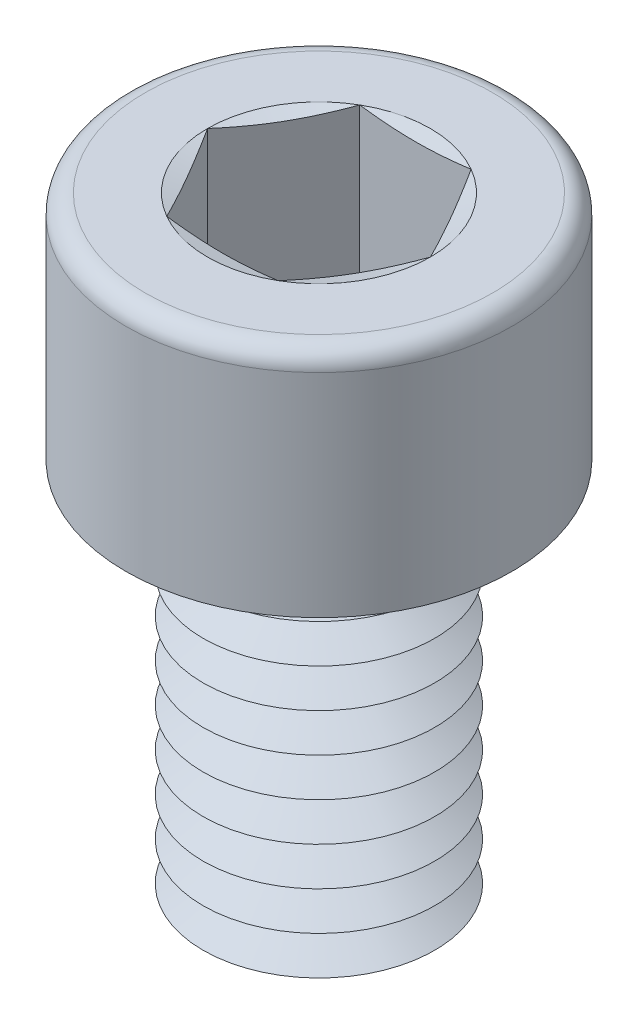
ISO-10303-21;
HEADER;
FILE_DESCRIPTION(('STEP AP214'),'2;1');
FILE_NAME('part.step','',(''),(''),'','','');
FILE_SCHEMA(('AUTOMOTIVE_DESIGN { 1 0 10303 214 1 1 1 1 }'));
ENDSEC;
DATA;
#1=APPLICATION_CONTEXT('core data for automotive mechanical design processes');
#2=APPLICATION_PROTOCOL_DEFINITION('international standard','automotive_design',2000,#1);
#3=PRODUCT_CONTEXT('',#1,'mechanical');
#4=PRODUCT('Part','Part','',(#3));
#5=PRODUCT_RELATED_PRODUCT_CATEGORY('part','',(#4));
#6=PRODUCT_DEFINITION_FORMATION('','',#4);
#7=PRODUCT_DEFINITION_CONTEXT('part definition',#1,'design');
#8=PRODUCT_DEFINITION('design','',#6,#7);
#9=PRODUCT_DEFINITION_SHAPE('','',#8);
#10=(LENGTH_UNIT() NAMED_UNIT(*) SI_UNIT(.MILLI.,.METRE.));
#11=(NAMED_UNIT(*) PLANE_ANGLE_UNIT() SI_UNIT($,.RADIAN.));
#12=(NAMED_UNIT(*) SI_UNIT($,.STERADIAN.) SOLID_ANGLE_UNIT());
#13=UNCERTAINTY_MEASURE_WITH_UNIT(LENGTH_MEASURE(1.E-05),#10,'distance_accuracy_value','');
#14=(GEOMETRIC_REPRESENTATION_CONTEXT(3) GLOBAL_UNCERTAINTY_ASSIGNED_CONTEXT((#13)) GLOBAL_UNIT_ASSIGNED_CONTEXT((#10,
#11,#12)) REPRESENTATION_CONTEXT('',''));
#15=CARTESIAN_POINT('',(0.,0.,0.));
#16=DIRECTION('',(0.,0.,1.));
#17=DIRECTION('',(1.,0.,0.));
#18=AXIS2_PLACEMENT_3D('',#15,#16,#17);
#19=CARTESIAN_POINT('',(0.,4.,0.));
#20=DIRECTION('',(0.,1.,0.));
#21=DIRECTION('',(0.,0.,1.));
#22=AXIS2_PLACEMENT_3D('',#19,#20,#21);
#23=CONICAL_SURFACE('',#22,2.13397459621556,1.0471975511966);
#24=CARTESIAN_POINT('',(0.,4.5,0.));
#25=DIRECTION('',(0.,1.,0.));
#26=DIRECTION('',(0.,0.,1.));
#27=AXIS2_PLACEMENT_3D('',#24,#25,#26);
#28=CIRCLE('',#27,3.);
#29=CARTESIAN_POINT('',(0.,4.5,3.));
#30=VERTEX_POINT('',#29);
#31=EDGE_CURVE('E391',#30,#30,#28,.T.);
#32=ORIENTED_EDGE('',*,*,#31,.F.);
#33=EDGE_LOOP('',(#32));
#34=FACE_BOUND('',#33,.T.);
#35=CARTESIAN_POINT('',(0.,4.,0.));
#36=DIRECTION('',(0.,1.,0.));
#37=DIRECTION('',(0.,0.,1.));
#38=AXIS2_PLACEMENT_3D('',#35,#36,#37);
#39=CIRCLE('',#38,2.13397459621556);
#40=CARTESIAN_POINT('',(0.,4.,2.13397459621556));
#41=VERTEX_POINT('',#40);
#42=EDGE_CURVE('E395',#41,#41,#39,.T.);
#43=ORIENTED_EDGE('',*,*,#42,.T.);
#44=EDGE_LOOP('',(#43));
#45=FACE_BOUND('',#44,.T.);
#46=ADVANCED_FACE('F41',(#34,#45),#23,.T.);
#47=CARTESIAN_POINT('',(0.,3.5,0.));
#48=DIRECTION('',(0.,-1.,0.));
#49=DIRECTION('',(0.,0.,-1.));
#50=AXIS2_PLACEMENT_3D('',#47,#48,#49);
#51=CONICAL_SURFACE('',#50,3.,1.0471975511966);
#52=ORIENTED_EDGE('',*,*,#42,.F.);
#53=EDGE_LOOP('',(#52));
#54=FACE_BOUND('',#53,.T.);
#55=CARTESIAN_POINT('',(0.,3.5,0.));
#56=DIRECTION('',(0.,1.,0.));
#57=DIRECTION('',(0.,0.,1.));
#58=AXIS2_PLACEMENT_3D('',#55,#56,#57);
#59=CIRCLE('',#58,3.);
#60=CARTESIAN_POINT('',(0.,3.5,3.));
#61=VERTEX_POINT('',#60);
#62=EDGE_CURVE('E398',#61,#61,#59,.T.);
#63=ORIENTED_EDGE('',*,*,#62,.T.);
#64=EDGE_LOOP('',(#63));
#65=FACE_BOUND('',#64,.T.);
#66=ADVANCED_FACE('F251',(#54,#65),#51,.T.);
#67=CARTESIAN_POINT('',(0.,0.,0.));
#68=DIRECTION('',(0.,1.,0.));
#69=DIRECTION('',(0.,0.,1.));
#70=AXIS2_PLACEMENT_3D('',#67,#68,#69);
#71=PLANE('',#70);
#72=CARTESIAN_POINT('',(0.,0.,0.));
#73=DIRECTION('',(0.,1.,0.));
#74=DIRECTION('',(0.,0.,1.));
#75=AXIS2_PLACEMENT_3D('',#72,#73,#74);
#76=CIRCLE('',#75,2.13397459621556);
#77=CARTESIAN_POINT('',(0.,0.,2.13397459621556));
#78=VERTEX_POINT('',#77);
#79=EDGE_CURVE('E426',#78,#78,#76,.T.);
#80=ORIENTED_EDGE('',*,*,#79,.F.);
#81=EDGE_LOOP('',(#80));
#82=FACE_BOUND('',#81,.T.);
#83=ADVANCED_FACE('F248',(#82),#71,.F.);
#84=CARTESIAN_POINT('',(0.,0.,0.));
#85=DIRECTION('',(0.,1.,0.));
#86=DIRECTION('',(0.,0.,1.));
#87=AXIS2_PLACEMENT_3D('',#84,#85,#86);
#88=CONICAL_SURFACE('',#87,2.13397459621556,1.0471975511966);
#89=CARTESIAN_POINT('',(0.,0.5,0.));
#90=DIRECTION('',(0.,1.,0.));
#91=DIRECTION('',(0.,0.,1.));
#92=AXIS2_PLACEMENT_3D('',#89,#90,#91);
#93=CIRCLE('',#92,3.);
#94=CARTESIAN_POINT('',(0.,0.5,3.));
#95=VERTEX_POINT('',#94);
#96=EDGE_CURVE('E422',#95,#95,#93,.T.);
#97=ORIENTED_EDGE('',*,*,#96,.F.);
#98=EDGE_LOOP('',(#97));
#99=FACE_BOUND('',#98,.T.);
#100=ORIENTED_EDGE('',*,*,#79,.T.);
#101=EDGE_LOOP('',(#100));
#102=FACE_BOUND('',#101,.T.);
#103=ADVANCED_FACE('F250',(#99,#102),#88,.T.);
#104=CARTESIAN_POINT('',(0.,0.5,0.));
#105=DIRECTION('',(0.,-1.,0.));
#106=DIRECTION('',(0.,0.,-1.));
#107=AXIS2_PLACEMENT_3D('',#104,#105,#106);
#108=CONICAL_SURFACE('',#107,3.,1.0471975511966);
#109=CARTESIAN_POINT('',(0.,1.,0.));
#110=DIRECTION('',(0.,1.,0.));
#111=DIRECTION('',(0.,0.,1.));
#112=AXIS2_PLACEMENT_3D('',#109,#110,#111);
#113=CIRCLE('',#112,2.13397459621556);
#114=CARTESIAN_POINT('',(0.,1.,2.13397459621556));
#115=VERTEX_POINT('',#114);
#116=EDGE_CURVE('E418',#115,#115,#113,.T.);
#117=ORIENTED_EDGE('',*,*,#116,.F.);
#118=EDGE_LOOP('',(#117));
#119=FACE_BOUND('',#118,.T.);
#120=ORIENTED_EDGE('',*,*,#96,.T.);
#121=EDGE_LOOP('',(#120));
#122=FACE_BOUND('',#121,.T.);
#123=ADVANCED_FACE('F291',(#119,#122),#108,.T.);
#124=CARTESIAN_POINT('',(0.,1.,0.));
#125=DIRECTION('',(0.,1.,0.));
#126=DIRECTION('',(0.,0.,1.));
#127=AXIS2_PLACEMENT_3D('',#124,#125,#126);
#128=CONICAL_SURFACE('',#127,2.13397459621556,1.0471975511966);
#129=CARTESIAN_POINT('',(0.,1.5,0.));
#130=DIRECTION('',(0.,1.,0.));
#131=DIRECTION('',(0.,0.,1.));
#132=AXIS2_PLACEMENT_3D('',#129,#130,#131);
#133=CIRCLE('',#132,3.);
#134=CARTESIAN_POINT('',(0.,1.5,3.));
#135=VERTEX_POINT('',#134);
#136=EDGE_CURVE('E414',#135,#135,#133,.T.);
#137=ORIENTED_EDGE('',*,*,#136,.F.);
#138=EDGE_LOOP('',(#137));
#139=FACE_BOUND('',#138,.T.);
#140=ORIENTED_EDGE('',*,*,#116,.T.);
#141=EDGE_LOOP('',(#140));
#142=FACE_BOUND('',#141,.T.);
#143=ADVANCED_FACE('F286',(#139,#142),#128,.T.);
#144=CARTESIAN_POINT('',(0.,1.5,0.));
#145=DIRECTION('',(0.,-1.,0.));
#146=DIRECTION('',(0.,0.,-1.));
#147=AXIS2_PLACEMENT_3D('',#144,#145,#146);
#148=CONICAL_SURFACE('',#147,3.,1.0471975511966);
#149=CARTESIAN_POINT('',(0.,2.,0.));
#150=DIRECTION('',(0.,1.,0.));
#151=DIRECTION('',(0.,0.,1.));
#152=AXIS2_PLACEMENT_3D('',#149,#150,#151);
#153=CIRCLE('',#152,2.13397459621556);
#154=CARTESIAN_POINT('',(0.,2.,2.13397459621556));
#155=VERTEX_POINT('',#154);
#156=EDGE_CURVE('E410',#155,#155,#153,.T.);
#157=ORIENTED_EDGE('',*,*,#156,.F.);
#158=EDGE_LOOP('',(#157));
#159=FACE_BOUND('',#158,.T.);
#160=ORIENTED_EDGE('',*,*,#136,.T.);
#161=EDGE_LOOP('',(#160));
#162=FACE_BOUND('',#161,.T.);
#163=ADVANCED_FACE('F283',(#159,#162),#148,.T.);
#164=CARTESIAN_POINT('',(0.,2.,0.));
#165=DIRECTION('',(0.,1.,0.));
#166=DIRECTION('',(0.,0.,1.));
#167=AXIS2_PLACEMENT_3D('',#164,#165,#166);
#168=CONICAL_SURFACE('',#167,2.13397459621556,1.0471975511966);
#169=CARTESIAN_POINT('',(0.,2.5,0.));
#170=DIRECTION('',(0.,1.,0.));
#171=DIRECTION('',(0.,0.,1.));
#172=AXIS2_PLACEMENT_3D('',#169,#170,#171);
#173=CIRCLE('',#172,3.);
#174=CARTESIAN_POINT('',(0.,2.5,3.));
#175=VERTEX_POINT('',#174);
#176=EDGE_CURVE('E406',#175,#175,#173,.T.);
#177=ORIENTED_EDGE('',*,*,#176,.F.);
#178=EDGE_LOOP('',(#177));
#179=FACE_BOUND('',#178,.T.);
#180=ORIENTED_EDGE('',*,*,#156,.T.);
#181=EDGE_LOOP('',(#180));
#182=FACE_BOUND('',#181,.T.);
#183=ADVANCED_FACE('F277',(#179,#182),#168,.T.);
#184=CARTESIAN_POINT('',(0.,2.5,0.));
#185=DIRECTION('',(0.,-1.,0.));
#186=DIRECTION('',(0.,0.,-1.));
#187=AXIS2_PLACEMENT_3D('',#184,#185,#186);
#188=CONICAL_SURFACE('',#187,3.,1.0471975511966);
#189=CARTESIAN_POINT('',(0.,3.,0.));
#190=DIRECTION('',(0.,1.,0.));
#191=DIRECTION('',(0.,0.,1.));
#192=AXIS2_PLACEMENT_3D('',#189,#190,#191);
#193=CIRCLE('',#192,2.13397459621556);
#194=CARTESIAN_POINT('',(0.,3.,2.13397459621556));
#195=VERTEX_POINT('',#194);
#196=EDGE_CURVE('E402',#195,#195,#193,.T.);
#197=ORIENTED_EDGE('',*,*,#196,.F.);
#198=EDGE_LOOP('',(#197));
#199=FACE_BOUND('',#198,.T.);
#200=ORIENTED_EDGE('',*,*,#176,.T.);
#201=EDGE_LOOP('',(#200));
#202=FACE_BOUND('',#201,.T.);
#203=ADVANCED_FACE('F273',(#199,#202),#188,.T.);
#204=CARTESIAN_POINT('',(0.,3.,0.));
#205=DIRECTION('',(0.,1.,0.));
#206=DIRECTION('',(0.,0.,1.));
#207=AXIS2_PLACEMENT_3D('',#204,#205,#206);
#208=CONICAL_SURFACE('',#207,2.13397459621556,1.0471975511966);
#209=ORIENTED_EDGE('',*,*,#62,.F.);
#210=EDGE_LOOP('',(#209));
#211=FACE_BOUND('',#210,.T.);
#212=ORIENTED_EDGE('',*,*,#196,.T.);
#213=EDGE_LOOP('',(#212));
#214=FACE_BOUND('',#213,.T.);
#215=ADVANCED_FACE('F276',(#211,#214),#208,.T.);
#216=CARTESIAN_POINT('',(0.,5.,0.));
#217=DIRECTION('',(0.,1.,0.));
#218=DIRECTION('',(0.,0.,1.));
#219=AXIS2_PLACEMENT_3D('',#216,#217,#218);
#220=CONICAL_SURFACE('',#219,2.13397459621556,1.0471975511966);
#221=CARTESIAN_POINT('',(0.,5.5,0.));
#222=DIRECTION('',(0.,1.,0.));
#223=DIRECTION('',(0.,0.,1.));
#224=AXIS2_PLACEMENT_3D('',#221,#222,#223);
#225=CIRCLE('',#224,3.);
#226=CARTESIAN_POINT('',(0.,5.5,3.));
#227=VERTEX_POINT('',#226);
#228=EDGE_CURVE('E383',#227,#227,#225,.T.);
#229=ORIENTED_EDGE('',*,*,#228,.F.);
#230=EDGE_LOOP('',(#229));
#231=FACE_BOUND('',#230,.T.);
#232=CARTESIAN_POINT('',(0.,5.,0.));
#233=DIRECTION('',(0.,1.,0.));
#234=DIRECTION('',(0.,0.,1.));
#235=AXIS2_PLACEMENT_3D('',#232,#233,#234);
#236=CIRCLE('',#235,2.13397459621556);
#237=CARTESIAN_POINT('',(0.,5.,2.13397459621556));
#238=VERTEX_POINT('',#237);
#239=EDGE_CURVE('E387',#238,#238,#236,.T.);
#240=ORIENTED_EDGE('',*,*,#239,.T.);
#241=EDGE_LOOP('',(#240));
#242=FACE_BOUND('',#241,.T.);
#243=ADVANCED_FACE('F281',(#231,#242),#220,.T.);
#244=CARTESIAN_POINT('',(0.,4.5,0.));
#245=DIRECTION('',(0.,-1.,0.));
#246=DIRECTION('',(0.,0.,-1.));
#247=AXIS2_PLACEMENT_3D('',#244,#245,#246);
#248=CONICAL_SURFACE('',#247,3.,1.0471975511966);
#249=ORIENTED_EDGE('',*,*,#239,.F.);
#250=EDGE_LOOP('',(#249));
#251=FACE_BOUND('',#250,.T.);
#252=ORIENTED_EDGE('',*,*,#31,.T.);
#253=EDGE_LOOP('',(#252));
#254=FACE_BOUND('',#253,.T.);
#255=ADVANCED_FACE('F670',(#251,#254),#248,.T.);
#256=CARTESIAN_POINT('',(0.,6.,0.));
#257=DIRECTION('',(0.,1.,0.));
#258=DIRECTION('',(0.,0.,1.));
#259=AXIS2_PLACEMENT_3D('',#256,#257,#258);
#260=CONICAL_SURFACE('',#259,2.13397459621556,1.0471975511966);
#261=CARTESIAN_POINT('',(0.,6.5,0.));
#262=DIRECTION('',(0.,1.,0.));
#263=DIRECTION('',(0.,0.,1.));
#264=AXIS2_PLACEMENT_3D('',#261,#262,#263);
#265=CIRCLE('',#264,3.);
#266=CARTESIAN_POINT('',(0.,6.5,3.));
#267=VERTEX_POINT('',#266);
#268=EDGE_CURVE('E376',#267,#267,#265,.T.);
#269=ORIENTED_EDGE('',*,*,#268,.F.);
#270=EDGE_LOOP('',(#269));
#271=FACE_BOUND('',#270,.T.);
#272=CARTESIAN_POINT('',(0.,6.,0.));
#273=DIRECTION('',(0.,1.,0.));
#274=DIRECTION('',(0.,0.,1.));
#275=AXIS2_PLACEMENT_3D('',#272,#273,#274);
#276=CIRCLE('',#275,2.13397459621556);
#277=CARTESIAN_POINT('',(0.,6.,2.13397459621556));
#278=VERTEX_POINT('',#277);
#279=EDGE_CURVE('E379',#278,#278,#276,.T.);
#280=ORIENTED_EDGE('',*,*,#279,.T.);
#281=EDGE_LOOP('',(#280));
#282=FACE_BOUND('',#281,.T.);
#283=ADVANCED_FACE('F679',(#271,#282),#260,.T.);
#284=CARTESIAN_POINT('',(0.,5.5,0.));
#285=DIRECTION('',(0.,-1.,0.));
#286=DIRECTION('',(0.,0.,-1.));
#287=AXIS2_PLACEMENT_3D('',#284,#285,#286);
#288=CONICAL_SURFACE('',#287,3.,1.0471975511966);
#289=ORIENTED_EDGE('',*,*,#279,.F.);
#290=EDGE_LOOP('',(#289));
#291=FACE_BOUND('',#290,.T.);
#292=ORIENTED_EDGE('',*,*,#228,.T.);
#293=EDGE_LOOP('',(#292));
#294=FACE_BOUND('',#293,.T.);
#295=ADVANCED_FACE('F689',(#291,#294),#288,.T.);
#296=CARTESIAN_POINT('',(0.,7.,0.));
#297=DIRECTION('',(0.,1.,0.));
#298=DIRECTION('',(0.,0.,1.));
#299=AXIS2_PLACEMENT_3D('',#296,#297,#298);
#300=CONICAL_SURFACE('',#299,2.13397459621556,1.0471975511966);
#301=CARTESIAN_POINT('',(0.,7.5,0.));
#302=DIRECTION('',(0.,1.,0.));
#303=DIRECTION('',(0.,0.,1.));
#304=AXIS2_PLACEMENT_3D('',#301,#302,#303);
#305=CIRCLE('',#304,3.);
#306=CARTESIAN_POINT('',(0.,7.5,3.));
#307=VERTEX_POINT('',#306);
#308=EDGE_CURVE('E368',#307,#307,#305,.T.);
#309=ORIENTED_EDGE('',*,*,#308,.F.);
#310=EDGE_LOOP('',(#309));
#311=FACE_BOUND('',#310,.T.);
#312=CARTESIAN_POINT('',(0.,7.,0.));
#313=DIRECTION('',(0.,1.,0.));
#314=DIRECTION('',(0.,0.,1.));
#315=AXIS2_PLACEMENT_3D('',#312,#313,#314);
#316=CIRCLE('',#315,2.13397459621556);
#317=CARTESIAN_POINT('',(0.,7.,2.13397459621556));
#318=VERTEX_POINT('',#317);
#319=EDGE_CURVE('E372',#318,#318,#316,.T.);
#320=ORIENTED_EDGE('',*,*,#319,.T.);
#321=EDGE_LOOP('',(#320));
#322=FACE_BOUND('',#321,.T.);
#323=ADVANCED_FACE('F699',(#311,#322),#300,.T.);
#324=CARTESIAN_POINT('',(0.,6.5,0.));
#325=DIRECTION('',(0.,-1.,0.));
#326=DIRECTION('',(0.,0.,-1.));
#327=AXIS2_PLACEMENT_3D('',#324,#325,#326);
#328=CONICAL_SURFACE('',#327,3.,1.0471975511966);
#329=ORIENTED_EDGE('',*,*,#319,.F.);
#330=EDGE_LOOP('',(#329));
#331=FACE_BOUND('',#330,.T.);
#332=ORIENTED_EDGE('',*,*,#268,.T.);
#333=EDGE_LOOP('',(#332));
#334=FACE_BOUND('',#333,.T.);
#335=ADVANCED_FACE('F709',(#331,#334),#328,.T.);
#336=CARTESIAN_POINT('',(0.,8.,0.));
#337=DIRECTION('',(0.,1.,0.));
#338=DIRECTION('',(0.,0.,1.));
#339=AXIS2_PLACEMENT_3D('',#336,#337,#338);
#340=CONICAL_SURFACE('',#339,2.13397459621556,1.0471975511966);
#341=CARTESIAN_POINT('',(0.,8.5,0.));
#342=DIRECTION('',(0.,1.,0.));
#343=DIRECTION('',(0.,0.,1.));
#344=AXIS2_PLACEMENT_3D('',#341,#342,#343);
#345=CIRCLE('',#344,3.);
#346=CARTESIAN_POINT('',(0.,8.5,3.));
#347=VERTEX_POINT('',#346);
#348=EDGE_CURVE('E353',#347,#347,#345,.T.);
#349=ORIENTED_EDGE('',*,*,#348,.F.);
#350=EDGE_LOOP('',(#349));
#351=FACE_BOUND('',#350,.T.);
#352=CARTESIAN_POINT('',(0.,8.,0.));
#353=DIRECTION('',(0.,1.,0.));
#354=DIRECTION('',(0.,0.,1.));
#355=AXIS2_PLACEMENT_3D('',#352,#353,#354);
#356=CIRCLE('',#355,2.13397459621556);
#357=CARTESIAN_POINT('',(0.,8.,2.13397459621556));
#358=VERTEX_POINT('',#357);
#359=EDGE_CURVE('E364',#358,#358,#356,.T.);
#360=ORIENTED_EDGE('',*,*,#359,.T.);
#361=EDGE_LOOP('',(#360));
#362=FACE_BOUND('',#361,.T.);
#363=ADVANCED_FACE('F719',(#351,#362),#340,.T.);
#364=CARTESIAN_POINT('',(0.,7.5,0.));
#365=DIRECTION('',(0.,-1.,0.));
#366=DIRECTION('',(0.,0.,-1.));
#367=AXIS2_PLACEMENT_3D('',#364,#365,#366);
#368=CONICAL_SURFACE('',#367,3.,1.0471975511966);
#369=ORIENTED_EDGE('',*,*,#359,.F.);
#370=EDGE_LOOP('',(#369));
#371=FACE_BOUND('',#370,.T.);
#372=ORIENTED_EDGE('',*,*,#308,.T.);
#373=EDGE_LOOP('',(#372));
#374=FACE_BOUND('',#373,.T.);
#375=ADVANCED_FACE('F729',(#371,#374),#368,.T.);
#376=CARTESIAN_POINT('',(0.,9.,0.));
#377=DIRECTION('',(0.,1.,0.));
#378=DIRECTION('',(0.,0.,1.));
#379=AXIS2_PLACEMENT_3D('',#376,#377,#378);
#380=CONICAL_SURFACE('',#379,2.13397459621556,1.0471975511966);
#381=CARTESIAN_POINT('',(0.,9.5,0.));
#382=DIRECTION('',(0.,1.,0.));
#383=DIRECTION('',(0.,0.,1.));
#384=AXIS2_PLACEMENT_3D('',#381,#382,#383);
#385=CIRCLE('',#384,3.);
#386=CARTESIAN_POINT('',(0.,9.5,3.));
#387=VERTEX_POINT('',#386);
#388=EDGE_CURVE('E360',#387,#387,#385,.T.);
#389=ORIENTED_EDGE('',*,*,#388,.F.);
#390=EDGE_LOOP('',(#389));
#391=FACE_BOUND('',#390,.T.);
#392=CARTESIAN_POINT('',(0.,9.,0.));
#393=DIRECTION('',(0.,1.,0.));
#394=DIRECTION('',(0.,0.,1.));
#395=AXIS2_PLACEMENT_3D('',#392,#393,#394);
#396=CIRCLE('',#395,2.13397459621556);
#397=CARTESIAN_POINT('',(0.,9.,2.13397459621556));
#398=VERTEX_POINT('',#397);
#399=EDGE_CURVE('E348',#398,#398,#396,.T.);
#400=ORIENTED_EDGE('',*,*,#399,.T.);
#401=EDGE_LOOP('',(#400));
#402=FACE_BOUND('',#401,.T.);
#403=ADVANCED_FACE('F739',(#391,#402),#380,.T.);
#404=CARTESIAN_POINT('',(0.,8.5,0.));
#405=DIRECTION('',(0.,-1.,0.));
#406=DIRECTION('',(0.,0.,-1.));
#407=AXIS2_PLACEMENT_3D('',#404,#405,#406);
#408=CONICAL_SURFACE('',#407,3.,1.0471975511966);
#409=ORIENTED_EDGE('',*,*,#399,.F.);
#410=EDGE_LOOP('',(#409));
#411=FACE_BOUND('',#410,.T.);
#412=ORIENTED_EDGE('',*,*,#348,.T.);
#413=EDGE_LOOP('',(#412));
#414=FACE_BOUND('',#413,.T.);
#415=ADVANCED_FACE('F195',(#411,#414),#408,.T.);
#416=CARTESIAN_POINT('',(0.,16.,0.));
#417=DIRECTION('',(0.,1.,0.));
#418=DIRECTION('',(0.,0.,1.));
#419=AXIS2_PLACEMENT_3D('',#416,#417,#418);
#420=PLANE('',#419);
#421=CARTESIAN_POINT('',(0.,16.,0.));
#422=DIRECTION('',(0.,1.,0.));
#423=DIRECTION('',(0.,0.,1.));
#424=AXIS2_PLACEMENT_3D('',#421,#422,#423);
#425=CIRCLE('',#424,2.88675134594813);
#426=CARTESIAN_POINT('',(1.44337567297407,16.,2.5));
#427=VERTEX_POINT('',#426);
#428=CARTESIAN_POINT('',(2.88675134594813,16.,0.));
#429=VERTEX_POINT('',#428);
#430=EDGE_CURVE('E121',#427,#429,#425,.T.);
#431=ORIENTED_EDGE('',*,*,#430,.F.);
#432=CARTESIAN_POINT('',(0.,16.,0.));
#433=DIRECTION('',(0.,1.,0.));
#434=DIRECTION('',(0.,0.,1.));
#435=AXIS2_PLACEMENT_3D('',#432,#433,#434);
#436=CIRCLE('',#435,2.88675134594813);
#437=CARTESIAN_POINT('',(-1.44337567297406,16.,2.5));
#438=VERTEX_POINT('',#437);
#439=EDGE_CURVE('E45',#438,#427,#436,.T.);
#440=ORIENTED_EDGE('',*,*,#439,.F.);
#441=CARTESIAN_POINT('',(-2.88675134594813,16.,0.));
#442=VERTEX_POINT('',#441);
#443=EDGE_CURVE('E138',#442,#438,#436,.T.);
#444=ORIENTED_EDGE('',*,*,#443,.F.);
#445=CARTESIAN_POINT('',(-1.44337567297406,16.,-2.5));
#446=VERTEX_POINT('',#445);
#447=EDGE_CURVE('E507',#446,#442,#436,.T.);
#448=ORIENTED_EDGE('',*,*,#447,.F.);
#449=CARTESIAN_POINT('',(1.44337567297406,16.,-2.5));
#450=VERTEX_POINT('',#449);
#451=EDGE_CURVE('E51',#450,#446,#436,.T.);
#452=ORIENTED_EDGE('',*,*,#451,.F.);
#453=EDGE_CURVE('E11',#429,#450,#436,.T.);
#454=ORIENTED_EDGE('',*,*,#453,.F.);
#455=EDGE_LOOP('',(#431,#440,#444,#448,#452,#454));
#456=FACE_BOUND('',#455,.T.);
#457=CARTESIAN_POINT('',(0.,16.,0.));
#458=DIRECTION('',(0.,1.,0.));
#459=DIRECTION('',(0.,0.,1.));
#460=AXIS2_PLACEMENT_3D('',#457,#458,#459);
#461=CIRCLE('',#460,4.5);
#462=CARTESIAN_POINT('',(0.,16.,4.5));
#463=VERTEX_POINT('',#462);
#464=EDGE_CURVE('E469',#463,#463,#461,.T.);
#465=ORIENTED_EDGE('',*,*,#464,.T.);
#466=EDGE_LOOP('',(#465));
#467=FACE_BOUND('',#466,.T.);
#468=ADVANCED_FACE('F140',(#456,#467),#420,.T.);
#469=CARTESIAN_POINT('',(0.,15.5,0.));
#470=DIRECTION('',(0.,1.,0.));
#471=DIRECTION('',(0.,0.,1.));
#472=AXIS2_PLACEMENT_3D('',#469,#470,#471);
#473=TOROIDAL_SURFACE('',#472,4.5,0.5);
#474=CARTESIAN_POINT('',(0.,15.5,0.));
#475=DIRECTION('',(0.,1.,0.));
#476=DIRECTION('',(0.,0.,1.));
#477=AXIS2_PLACEMENT_3D('',#474,#475,#476);
#478=CIRCLE('',#477,5.);
#479=CARTESIAN_POINT('',(0.,15.5,5.));
#480=VERTEX_POINT('',#479);
#481=EDGE_CURVE('E473',#480,#480,#478,.F.);
#482=ORIENTED_EDGE('',*,*,#481,.F.);
#483=EDGE_LOOP('',(#482));
#484=FACE_BOUND('',#483,.T.);
#485=ORIENTED_EDGE('',*,*,#464,.F.);
#486=EDGE_LOOP('',(#485));
#487=FACE_BOUND('',#486,.T.);
#488=ADVANCED_FACE('F43',(#484,#487),#473,.T.);
#489=CARTESIAN_POINT('',(0.,16.,0.));
#490=DIRECTION('',(0.,-1.,0.));
#491=DIRECTION('',(0.,0.,-1.));
#492=AXIS2_PLACEMENT_3D('',#489,#490,#491);
#493=CYLINDRICAL_SURFACE('',#492,5.);
#494=ORIENTED_EDGE('',*,*,#481,.T.);
#495=EDGE_LOOP('',(#494));
#496=FACE_BOUND('',#495,.T.);
#497=CARTESIAN_POINT('',(0.,10.,0.));
#498=DIRECTION('',(0.,1.,0.));
#499=DIRECTION('',(0.,0.,1.));
#500=AXIS2_PLACEMENT_3D('',#497,#498,#499);
#501=CIRCLE('',#500,5.);
#502=CARTESIAN_POINT('',(0.,10.,5.));
#503=VERTEX_POINT('',#502);
#504=EDGE_CURVE('E458',#503,#503,#501,.T.);
#505=ORIENTED_EDGE('',*,*,#504,.T.);
#506=EDGE_LOOP('',(#505));
#507=FACE_BOUND('',#506,.T.);
#508=ADVANCED_FACE('F243',(#496,#507),#493,.T.);
#509=CARTESIAN_POINT('',(0.,10.,0.));
#510=DIRECTION('',(0.,1.,0.));
#511=DIRECTION('',(0.,0.,1.));
#512=AXIS2_PLACEMENT_3D('',#509,#510,#511);
#513=PLANE('',#512);
#514=ORIENTED_EDGE('',*,*,#504,.F.);
#515=EDGE_LOOP('',(#514));
#516=FACE_BOUND('',#515,.T.);
#517=CARTESIAN_POINT('',(0.,10.,0.));
#518=DIRECTION('',(0.,1.,0.));
#519=DIRECTION('',(0.,0.,1.));
#520=AXIS2_PLACEMENT_3D('',#517,#518,#519);
#521=CIRCLE('',#520,3.);
#522=CARTESIAN_POINT('',(0.,10.,3.));
#523=VERTEX_POINT('',#522);
#524=EDGE_CURVE('E466',#523,#523,#521,.T.);
#525=ORIENTED_EDGE('',*,*,#524,.T.);
#526=EDGE_LOOP('',(#525));
#527=FACE_BOUND('',#526,.T.);
#528=ADVANCED_FACE('F239',(#516,#527),#513,.F.);
#529=CARTESIAN_POINT('',(0.,10.,0.));
#530=DIRECTION('',(0.,-1.,0.));
#531=DIRECTION('',(0.,0.,-1.));
#532=AXIS2_PLACEMENT_3D('',#529,#530,#531);
#533=CYLINDRICAL_SURFACE('',#532,3.);
#534=ORIENTED_EDGE('',*,*,#388,.T.);
#535=EDGE_LOOP('',(#534));
#536=FACE_BOUND('',#535,.T.);
#537=ORIENTED_EDGE('',*,*,#524,.F.);
#538=EDGE_LOOP('',(#537));
#539=FACE_BOUND('',#538,.T.);
#540=ADVANCED_FACE('F242',(#536,#539),#533,.T.);
#541=CARTESIAN_POINT('',(0.,16.,0.));
#542=DIRECTION('',(0.,1.,0.));
#543=DIRECTION('',(0.,0.,1.));
#544=AXIS2_PLACEMENT_3D('',#541,#542,#543);
#545=CONICAL_SURFACE('',#544,2.88675134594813,1.30899693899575);
#546=ORIENTED_EDGE('',*,*,#439,.T.);
#547=CARTESIAN_POINT('',(-3.76800948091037,16.438146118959,2.5));
#548=CARTESIAN_POINT('',(-3.65512241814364,16.4129478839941,2.5));
#549=CARTESIAN_POINT('',(-3.54216337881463,16.3880668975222,2.5));
#550=CARTESIAN_POINT('',(-3.31606595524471,16.3391094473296,2.5));
#551=CARTESIAN_POINT('',(-3.20292756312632,16.3150330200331,2.5));
#552=CARTESIAN_POINT('',(-2.97632910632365,16.2678326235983,2.5));
#553=CARTESIAN_POINT('',(-2.86286882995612,16.2447096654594,2.5));
#554=CARTESIAN_POINT('',(-2.63570880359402,16.1996785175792,2.5));
#555=CARTESIAN_POINT('',(-2.52200905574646,16.1777703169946,2.5));
#556=CARTESIAN_POINT('',(-2.18246936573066,16.1146408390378,2.5));
#557=CARTESIAN_POINT('',(-1.95621666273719,16.0755946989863,2.5));
#558=CARTESIAN_POINT('',(-1.50233128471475,16.0064242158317,2.5));
#559=CARTESIAN_POINT('',(-1.27469889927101,15.9762980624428,2.5));
#560=CARTESIAN_POINT('',(-0.930935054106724,15.9407375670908,2.5));
#561=CARTESIAN_POINT('',(-0.81530656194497,15.9304588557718,2.5));
#562=CARTESIAN_POINT('',(-0.583775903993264,15.9137426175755,2.5));
#563=CARTESIAN_POINT('',(-0.467873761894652,15.9073047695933,2.5));
#564=CARTESIAN_POINT('',(-0.235955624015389,15.8986442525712,2.5));
#565=CARTESIAN_POINT('',(-0.119939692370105,15.8964198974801,2.5));
#566=CARTESIAN_POINT('',(0.112094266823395,15.8963223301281,2.5));
#567=CARTESIAN_POINT('',(0.228112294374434,15.8984491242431,2.5));
#568=CARTESIAN_POINT('',(0.460464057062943,15.9069362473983,2.5));
#569=CARTESIAN_POINT('',(0.576797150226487,15.9133138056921,2.5));
#570=CARTESIAN_POINT('',(0.809186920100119,15.9299460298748,2.5));
#571=CARTESIAN_POINT('',(0.925243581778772,15.940200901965,2.5));
#572=CARTESIAN_POINT('',(1.15707831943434,15.9640809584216,2.5));
#573=CARTESIAN_POINT('',(1.27285617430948,15.9777082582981,2.5));
#574=CARTESIAN_POINT('',(1.50403978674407,16.0077859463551,2.5));
#575=CARTESIAN_POINT('',(1.61944554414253,16.0242363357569,2.5));
#576=CARTESIAN_POINT('',(1.971160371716,16.0779484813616,2.5));
#577=CARTESIAN_POINT('',(2.20690406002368,16.1188940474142,2.5));
#578=CARTESIAN_POINT('',(2.67723558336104,16.2069642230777,2.5));
#579=CARTESIAN_POINT('',(2.91182322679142,16.2540898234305,2.5));
#580=CARTESIAN_POINT('',(3.38022088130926,16.3523532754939,2.5));
#581=CARTESIAN_POINT('',(3.61403064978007,16.4034922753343,2.5));
#582=CARTESIAN_POINT('',(4.08105387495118,16.5084282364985,2.5));
#583=CARTESIAN_POINT('',(4.31426731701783,16.5622252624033,2.5));
#584=CARTESIAN_POINT('',(4.77742011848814,16.6709766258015,2.5));
#585=CARTESIAN_POINT('',(5.00736469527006,16.7259088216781,2.5));
#586=CARTESIAN_POINT('',(5.46695141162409,16.8370433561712,2.5));
#587=CARTESIAN_POINT('',(5.69659354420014,16.8932457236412,2.5));
#588=CARTESIAN_POINT('',(6.15532898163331,17.0064970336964,2.5));
#589=CARTESIAN_POINT('',(6.38442260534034,17.0635446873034,2.5));
#590=CARTESIAN_POINT('',(6.84242442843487,17.1783451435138,2.5));
#591=CARTESIAN_POINT('',(7.07133263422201,17.2360979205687,2.5));
#592=CARTESIAN_POINT('',(7.30017784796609,17.2940964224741,2.5));
#593=B_SPLINE_CURVE_WITH_KNOTS('',3,(#547,#548,#549,#550,#551,#552,#553,#554,#555,#556,#557,
#558,#559,#560,#561,#562,#563,#564,#565,#566,#567,#568,#569,#570,#571,#572,#573,#574,#575,#576,
#577,#578,#579,#580,#581,#582,#583,#584,#585,#586,#587,#588,#589,#590,#591,#592),.UNSPECIFIED.,
.F.,.F.,(4,2,2,2,2,2,2,2,2,2,2,2,2,2,2,2,2,2,2,2,2,2,4),(0.,0.346996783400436,0.694009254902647,
1.04138068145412,1.38874900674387,2.07743762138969,2.76598637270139,3.11418615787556,
3.46235682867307,3.81038814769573,4.15841997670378,4.50787110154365,4.85734081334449,
5.20703030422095,5.55671994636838,6.27438533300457,6.99216591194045,7.71015258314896,
8.42815670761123,9.13739674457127,9.84665290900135,10.5549206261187,11.2631627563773),.UNSPECIFIED.);
#594=EDGE_CURVE('E127',#438,#427,#593,.T.);
#595=ORIENTED_EDGE('',*,*,#594,.F.);
#596=EDGE_LOOP('',(#546,#595));
#597=FACE_BOUND('',#596,.T.);
#598=ADVANCED_FACE('F132',(#597),#545,.F.);
#599=ORIENTED_EDGE('',*,*,#443,.T.);
#600=CARTESIAN_POINT('',(-2.88686681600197,16.000030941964,-0.000200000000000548));
#601=CARTESIAN_POINT('',(-2.82691749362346,15.9839595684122,0.103635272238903));
#602=CARTESIAN_POINT('',(-2.7668594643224,15.9693693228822,0.207658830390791));
#603=CARTESIAN_POINT('',(-2.64653127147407,15.9437355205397,0.416073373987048));
#604=CARTESIAN_POINT('',(-2.58626103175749,15.9326934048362,0.520464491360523));
#605=CARTESIAN_POINT('',(-2.4658738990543,15.9148005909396,0.728981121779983));
#606=CARTESIAN_POINT('',(-2.40575782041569,15.9079285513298,0.833105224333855));
#607=CARTESIAN_POINT('',(-2.28544898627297,15.8987138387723,1.04148623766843));
#608=CARTESIAN_POINT('',(-2.22525624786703,15.8963702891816,1.14574311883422));
#609=CARTESIAN_POINT('',(-2.10487077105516,15.8963702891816,1.35425688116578));
#610=CARTESIAN_POINT('',(-2.04467803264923,15.8987138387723,1.45851376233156));
#611=CARTESIAN_POINT('',(-1.9243691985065,15.9079285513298,1.66689477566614));
#612=CARTESIAN_POINT('',(-1.86425311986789,15.9148005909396,1.77101887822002));
#613=CARTESIAN_POINT('',(-1.7438659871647,15.9326934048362,1.97953550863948));
#614=CARTESIAN_POINT('',(-1.68359574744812,15.9437355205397,2.08392662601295));
#615=CARTESIAN_POINT('',(-1.56326755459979,15.9693693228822,2.29234116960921));
#616=CARTESIAN_POINT('',(-1.50320952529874,15.9839595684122,2.3963647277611));
#617=CARTESIAN_POINT('',(-1.44326020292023,16.000030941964,2.5002));
#618=B_SPLINE_CURVE_WITH_KNOTS('',3,(#600,#601,#602,#603,#604,#605,#606,#607,#608,#609,#610,
#611,#612,#613,#614,#615,#616,#617),.UNSPECIFIED.,.F.,.F.,(4,2,2,2,2,2,2,2,4),(0.,
0.362931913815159,0.726011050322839,1.08721601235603,1.44835104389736,1.80948607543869,
2.17069103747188,2.53377017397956,2.89670208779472),.UNSPECIFIED.);
#619=EDGE_CURVE('E163',#442,#438,#618,.T.);
#620=ORIENTED_EDGE('',*,*,#619,.F.);
#621=EDGE_LOOP('',(#599,#620));
#622=FACE_BOUND('',#621,.T.);
#623=ADVANCED_FACE('F258',(#622),#545,.F.);
#624=ORIENTED_EDGE('',*,*,#447,.T.);
#625=CARTESIAN_POINT('',(-1.44326020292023,16.000030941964,-2.5002));
#626=CARTESIAN_POINT('',(-1.50320952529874,15.9839595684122,-2.3963647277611));
#627=CARTESIAN_POINT('',(-1.56326755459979,15.9693693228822,-2.29234116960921));
#628=CARTESIAN_POINT('',(-1.68359574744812,15.9437355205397,-2.08392662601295));
#629=CARTESIAN_POINT('',(-1.7438659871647,15.9326934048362,-1.97953550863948));
#630=CARTESIAN_POINT('',(-1.86425311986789,15.9148005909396,-1.77101887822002));
#631=CARTESIAN_POINT('',(-1.9243691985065,15.9079285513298,-1.66689477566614));
#632=CARTESIAN_POINT('',(-2.04467803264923,15.8987138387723,-1.45851376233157));
#633=CARTESIAN_POINT('',(-2.10487077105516,15.8963702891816,-1.35425688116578));
#634=CARTESIAN_POINT('',(-2.22525624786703,15.8963702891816,-1.14574311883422));
#635=CARTESIAN_POINT('',(-2.28544898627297,15.8987138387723,-1.04148623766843));
#636=CARTESIAN_POINT('',(-2.40575782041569,15.9079285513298,-0.833105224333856));
#637=CARTESIAN_POINT('',(-2.4658738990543,15.9148005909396,-0.728981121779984));
#638=CARTESIAN_POINT('',(-2.58626103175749,15.9326934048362,-0.520464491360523));
#639=CARTESIAN_POINT('',(-2.64653127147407,15.9437355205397,-0.416073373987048));
#640=CARTESIAN_POINT('',(-2.7668594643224,15.9693693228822,-0.207658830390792));
#641=CARTESIAN_POINT('',(-2.82691749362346,15.9839595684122,-0.103635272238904));
#642=CARTESIAN_POINT('',(-2.88686681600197,16.000030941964,0.000199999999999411));
#643=B_SPLINE_CURVE_WITH_KNOTS('',3,(#625,#626,#627,#628,#629,#630,#631,#632,#633,#634,#635,
#636,#637,#638,#639,#640,#641,#642),.UNSPECIFIED.,.F.,.F.,(4,2,2,2,2,2,2,2,4),(0.,
0.362931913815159,0.726011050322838,1.08721601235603,1.44835104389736,1.80948607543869,
2.17069103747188,2.53377017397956,2.89670208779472),.UNSPECIFIED.);
#644=EDGE_CURVE('E63',#446,#442,#643,.T.);
#645=ORIENTED_EDGE('',*,*,#644,.F.);
#646=EDGE_LOOP('',(#624,#645));
#647=FACE_BOUND('',#646,.T.);
#648=ADVANCED_FACE('F193',(#647),#545,.F.);
#649=ORIENTED_EDGE('',*,*,#451,.T.);
#650=CARTESIAN_POINT('',(-3.76800948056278,16.4381461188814,-2.5));
#651=CARTESIAN_POINT('',(-3.65512241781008,16.4129478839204,-2.5));
#652=CARTESIAN_POINT('',(-3.54216337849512,16.3880668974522,-2.5));
#653=CARTESIAN_POINT('',(-3.31606595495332,16.3391094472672,-2.5));
#654=CARTESIAN_POINT('',(-3.202927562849,16.3150330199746,-2.5));
#655=CARTESIAN_POINT('',(-2.97632910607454,16.2678326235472,-2.5));
#656=CARTESIAN_POINT('',(-2.86286882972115,16.244709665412,-2.5));
#657=CARTESIAN_POINT('',(-2.63570880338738,16.1996785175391,-2.5));
#658=CARTESIAN_POINT('',(-2.522009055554,16.177770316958,-2.5));
#659=CARTESIAN_POINT('',(-2.18246936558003,16.1146408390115,-2.5));
#660=CARTESIAN_POINT('',(-1.95621666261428,16.0755946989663,-2.5));
#661=CARTESIAN_POINT('',(-1.50233128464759,16.0064242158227,-2.5));
#662=CARTESIAN_POINT('',(-1.27469889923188,15.9762980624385,-2.5));
#663=CARTESIAN_POINT('',(-0.93093505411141,15.9407375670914,-2.5));
#664=CARTESIAN_POINT('',(-0.815306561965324,15.9304588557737,-2.5));
#665=CARTESIAN_POINT('',(-0.583775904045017,15.9137426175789,-2.5));
#666=CARTESIAN_POINT('',(-0.467873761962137,15.9073047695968,-2.5));
#667=CARTESIAN_POINT('',(-0.23595562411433,15.8986442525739,-2.5));
#668=CARTESIAN_POINT('',(-0.119939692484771,15.8964198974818,-2.5));
#669=CARTESIAN_POINT('',(0.112094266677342,15.8963223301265,-2.5));
#670=CARTESIAN_POINT('',(0.228112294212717,15.8984491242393,-2.5));
#671=CARTESIAN_POINT('',(0.460464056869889,15.9069362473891,-2.5));
#672=CARTESIAN_POINT('',(0.576797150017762,15.9133138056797,-2.5));
#673=CARTESIAN_POINT('',(0.809186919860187,15.9299460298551,-2.5));
#674=CARTESIAN_POINT('',(0.925243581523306,15.9402009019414,-2.5));
#675=CARTESIAN_POINT('',(1.1570783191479,15.9640809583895,-2.5));
#676=CARTESIAN_POINT('',(1.27285617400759,15.9777082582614,-2.5));
#677=CARTESIAN_POINT('',(1.50403978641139,16.0077859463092,-2.5));
#678=CARTESIAN_POINT('',(1.61944554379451,16.0242363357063,-2.5));
#679=CARTESIAN_POINT('',(1.97116037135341,16.0779484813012,-2.5));
#680=CARTESIAN_POINT('',(2.20690405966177,16.1188940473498,-2.5));
#681=CARTESIAN_POINT('',(2.67723558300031,16.2069642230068,-2.5));
#682=CARTESIAN_POINT('',(2.9118232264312,16.2540898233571,-2.5));
#683=CARTESIAN_POINT('',(3.38022088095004,16.3523532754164,-2.5));
#684=CARTESIAN_POINT('',(3.61403064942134,16.4034922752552,-2.5));
#685=CARTESIAN_POINT('',(4.08105387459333,16.5084282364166,-2.5));
#686=CARTESIAN_POINT('',(4.31426731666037,16.5622252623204,-2.5));
#687=CARTESIAN_POINT('',(4.77742011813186,16.6709766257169,-2.5));
#688=CARTESIAN_POINT('',(5.00736469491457,16.7259088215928,-2.5));
#689=CARTESIAN_POINT('',(5.46695141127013,16.8370433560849,-2.5));
#690=CARTESIAN_POINT('',(5.69659354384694,16.8932457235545,-2.5));
#691=CARTESIAN_POINT('',(6.15532898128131,17.006497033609,-2.5));
#692=CARTESIAN_POINT('',(6.3844226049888,17.0635446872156,-2.5));
#693=CARTESIAN_POINT('',(6.84242442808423,17.1783451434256,-2.5));
#694=CARTESIAN_POINT('',(7.07133263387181,17.2360979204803,-2.5));
#695=CARTESIAN_POINT('',(7.30017784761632,17.2940964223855,-2.5));
#696=B_SPLINE_CURVE_WITH_KNOTS('',3,(#650,#651,#652,#653,#654,#655,#656,#657,#658,#659,#660,
#661,#662,#663,#664,#665,#666,#667,#668,#669,#670,#671,#672,#673,#674,#675,#676,#677,#678,#679,
#680,#681,#682,#683,#684,#685,#686,#687,#688,#689,#690,#691,#692,#693,#694,#695),.UNSPECIFIED.,
.F.,.F.,(4,2,2,2,2,2,2,2,2,2,2,2,2,2,2,2,2,2,2,2,2,2,4),(0.,0.346996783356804,0.69400925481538,
1.04138068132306,1.38874900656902,2.07743762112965,2.76598637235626,3.11418615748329,
3.46235682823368,3.81038814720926,4.15841997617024,4.50787110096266,4.85734081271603,
5.2070303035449,5.55671994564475,6.27438533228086,6.99216591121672,7.71015258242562,
8.42815670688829,9.13739674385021,9.84665290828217,10.5549206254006,11.2631627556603),.UNSPECIFIED.);
#697=EDGE_CURVE('E214',#450,#446,#696,.F.);
#698=ORIENTED_EDGE('',*,*,#697,.F.);
#699=EDGE_LOOP('',(#649,#698));
#700=FACE_BOUND('',#699,.T.);
#701=ADVANCED_FACE('F188',(#700),#545,.F.);
#702=ORIENTED_EDGE('',*,*,#453,.T.);
#703=CARTESIAN_POINT('',(2.88686681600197,16.000030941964,0.000199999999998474));
#704=CARTESIAN_POINT('',(2.82691749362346,15.9839595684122,-0.103635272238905));
#705=CARTESIAN_POINT('',(2.7668594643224,15.9693693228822,-0.207658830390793));
#706=CARTESIAN_POINT('',(2.64653127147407,15.9437355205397,-0.416073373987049));
#707=CARTESIAN_POINT('',(2.58626103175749,15.9326934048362,-0.520464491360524));
#708=CARTESIAN_POINT('',(2.4658738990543,15.9148005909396,-0.728981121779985));
#709=CARTESIAN_POINT('',(2.40575782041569,15.9079285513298,-0.833105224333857));
#710=CARTESIAN_POINT('',(2.28544898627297,15.8987138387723,-1.04148623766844));
#711=CARTESIAN_POINT('',(2.22525624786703,15.8963702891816,-1.14574311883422));
#712=CARTESIAN_POINT('',(2.10487077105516,15.8963702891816,-1.35425688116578));
#713=CARTESIAN_POINT('',(2.04467803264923,15.8987138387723,-1.45851376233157));
#714=CARTESIAN_POINT('',(1.9243691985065,15.9079285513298,-1.66689477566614));
#715=CARTESIAN_POINT('',(1.86425311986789,15.9148005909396,-1.77101887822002));
#716=CARTESIAN_POINT('',(1.7438659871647,15.9326934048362,-1.97953550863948));
#717=CARTESIAN_POINT('',(1.68359574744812,15.9437355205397,-2.08392662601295));
#718=CARTESIAN_POINT('',(1.56326755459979,15.9693693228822,-2.29234116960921));
#719=CARTESIAN_POINT('',(1.50320952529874,15.9839595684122,-2.3963647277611));
#720=CARTESIAN_POINT('',(1.44326020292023,16.000030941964,-2.5002));
#721=B_SPLINE_CURVE_WITH_KNOTS('',3,(#703,#704,#705,#706,#707,#708,#709,#710,#711,#712,#713,
#714,#715,#716,#717,#718,#719,#720),.UNSPECIFIED.,.F.,.F.,(4,2,2,2,2,2,2,2,4),(0.,
0.362931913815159,0.726011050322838,1.08721601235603,1.44835104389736,1.80948607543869,
2.17069103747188,2.53377017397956,2.89670208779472),.UNSPECIFIED.);
#722=EDGE_CURVE('E56',#429,#450,#721,.T.);
#723=ORIENTED_EDGE('',*,*,#722,.F.);
#724=EDGE_LOOP('',(#702,#723));
#725=FACE_BOUND('',#724,.T.);
#726=ADVANCED_FACE('F192',(#725),#545,.F.);
#727=ORIENTED_EDGE('',*,*,#430,.T.);
#728=CARTESIAN_POINT('',(1.44326020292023,16.000030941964,2.5002));
#729=CARTESIAN_POINT('',(1.50320952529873,15.9839595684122,2.3963647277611));
#730=CARTESIAN_POINT('',(1.56326755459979,15.9693693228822,2.29234116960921));
#731=CARTESIAN_POINT('',(1.68359574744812,15.9437355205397,2.08392662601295));
#732=CARTESIAN_POINT('',(1.7438659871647,15.9326934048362,1.97953550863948));
#733=CARTESIAN_POINT('',(1.86425311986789,15.9148005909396,1.77101887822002));
#734=CARTESIAN_POINT('',(1.9243691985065,15.9079285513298,1.66689477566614));
#735=CARTESIAN_POINT('',(2.04467803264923,15.8987138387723,1.45851376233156));
#736=CARTESIAN_POINT('',(2.10487077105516,15.8963702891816,1.35425688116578));
#737=CARTESIAN_POINT('',(2.22525624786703,15.8963702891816,1.14574311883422));
#738=CARTESIAN_POINT('',(2.28544898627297,15.8987138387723,1.04148623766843));
#739=CARTESIAN_POINT('',(2.40575782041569,15.9079285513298,0.833105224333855));
#740=CARTESIAN_POINT('',(2.4658738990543,15.9148005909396,0.728981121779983));
#741=CARTESIAN_POINT('',(2.58626103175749,15.9326934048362,0.520464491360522));
#742=CARTESIAN_POINT('',(2.64653127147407,15.9437355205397,0.416073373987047));
#743=CARTESIAN_POINT('',(2.7668594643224,15.9693693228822,0.207658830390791));
#744=CARTESIAN_POINT('',(2.82691749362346,15.9839595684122,0.103635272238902));
#745=CARTESIAN_POINT('',(2.88686681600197,16.000030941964,-0.000200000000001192));
#746=B_SPLINE_CURVE_WITH_KNOTS('',3,(#728,#729,#730,#731,#732,#733,#734,#735,#736,#737,#738,
#739,#740,#741,#742,#743,#744,#745),.UNSPECIFIED.,.F.,.F.,(4,2,2,2,2,2,2,2,4),(0.,
0.362931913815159,0.726011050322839,1.08721601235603,1.44835104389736,1.80948607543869,
2.17069103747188,2.53377017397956,2.89670208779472),.UNSPECIFIED.);
#747=EDGE_CURVE('E117',#427,#429,#746,.T.);
#748=ORIENTED_EDGE('',*,*,#747,.F.);
#749=EDGE_LOOP('',(#727,#748));
#750=FACE_BOUND('',#749,.T.);
#751=ADVANCED_FACE('F119',(#750),#545,.F.);
#752=CARTESIAN_POINT('',(0.,11.,0.));
#753=DIRECTION('',(0.,1.,0.));
#754=DIRECTION('',(0.,0.,1.));
#755=AXIS2_PLACEMENT_3D('',#752,#753,#754);
#756=CONICAL_SURFACE('',#755,2.5,1.0471975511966);
#757=CARTESIAN_POINT('',(0.,9.55662432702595,0.));
#758=VERTEX_POINT('',#757);
#759=VERTEX_LOOP('',#758);
#760=FACE_BOUND('',#759,.T.);
#761=CARTESIAN_POINT('',(0.,11.,0.));
#762=DIRECTION('',(0.,1.,0.));
#763=DIRECTION('',(0.,0.,1.));
#764=AXIS2_PLACEMENT_3D('',#761,#762,#763);
#765=CIRCLE('',#764,2.5);
#766=CARTESIAN_POINT('',(0.,11.,2.5));
#767=VERTEX_POINT('',#766);
#768=CARTESIAN_POINT('',(2.16506350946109,11.,1.25000000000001));
#769=VERTEX_POINT('',#768);
#770=EDGE_CURVE('E430',#767,#769,#765,.T.);
#771=ORIENTED_EDGE('',*,*,#770,.T.);
#772=CARTESIAN_POINT('',(0.,11.,0.));
#773=DIRECTION('',(0.,1.,0.));
#774=DIRECTION('',(0.,0.,1.));
#775=AXIS2_PLACEMENT_3D('',#772,#773,#774);
#776=CIRCLE('',#775,2.5);
#777=CARTESIAN_POINT('',(2.1650635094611,11.,-1.25));
#778=VERTEX_POINT('',#777);
#779=EDGE_CURVE('E139',#769,#778,#776,.T.);
#780=ORIENTED_EDGE('',*,*,#779,.T.);
#781=CARTESIAN_POINT('',(0.,11.,-2.5));
#782=VERTEX_POINT('',#781);
#783=EDGE_CURVE('E485',#778,#782,#776,.T.);
#784=ORIENTED_EDGE('',*,*,#783,.T.);
#785=CARTESIAN_POINT('',(-2.1650635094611,11.,-1.25));
#786=VERTEX_POINT('',#785);
#787=EDGE_CURVE('E484',#782,#786,#776,.T.);
#788=ORIENTED_EDGE('',*,*,#787,.T.);
#789=CARTESIAN_POINT('',(-2.16506350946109,11.,1.25000000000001));
#790=VERTEX_POINT('',#789);
#791=EDGE_CURVE('E478',#786,#790,#776,.T.);
#792=ORIENTED_EDGE('',*,*,#791,.T.);
#793=EDGE_CURVE('E476',#790,#767,#776,.T.);
#794=ORIENTED_EDGE('',*,*,#793,.T.);
#795=EDGE_LOOP('',(#771,#780,#784,#788,#792,#794));
#796=FACE_BOUND('',#795,.T.);
#797=ADVANCED_FACE('F301',(#760,#796),#756,.F.);
#798=CARTESIAN_POINT('',(1.44337567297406,11.,-2.5));
#799=DIRECTION('',(0.,1.,0.));
#800=DIRECTION('',(0.,0.,1.));
#801=AXIS2_PLACEMENT_3D('',#798,#799,#800);
#802=PLANE('',#801);
#803=ORIENTED_EDGE('',*,*,#787,.F.);
#804=DIRECTION('',(-1.,0.,0.));
#805=VECTOR('',#804,1.);
#806=CARTESIAN_POINT('',(1.44337567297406,11.,-2.5));
#807=LINE('',#806,#805);
#808=CARTESIAN_POINT('',(-1.44337567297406,11.,-2.5));
#809=VERTEX_POINT('',#808);
#810=EDGE_CURVE('E438',#782,#809,#807,.T.);
#811=ORIENTED_EDGE('',*,*,#810,.T.);
#812=DIRECTION('',(-0.5,0.,0.866025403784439));
#813=VECTOR('',#812,1.);
#814=CARTESIAN_POINT('',(-1.44337567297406,11.,-2.5));
#815=LINE('',#814,#813);
#816=EDGE_CURVE('E338',#809,#786,#815,.T.);
#817=ORIENTED_EDGE('',*,*,#816,.T.);
#818=EDGE_LOOP('',(#803,#811,#817));
#819=FACE_BOUND('',#818,.T.);
#820=ADVANCED_FACE('F304',(#819),#802,.T.);
#821=ORIENTED_EDGE('',*,*,#791,.F.);
#822=CARTESIAN_POINT('',(-2.88675134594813,11.,0.));
#823=VERTEX_POINT('',#822);
#824=EDGE_CURVE('E443',#786,#823,#815,.T.);
#825=ORIENTED_EDGE('',*,*,#824,.T.);
#826=DIRECTION('',(0.5,0.,0.866025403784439));
#827=VECTOR('',#826,1.);
#828=CARTESIAN_POINT('',(-2.88675134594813,11.,0.));
#829=LINE('',#828,#827);
#830=EDGE_CURVE('E328',#823,#790,#829,.T.);
#831=ORIENTED_EDGE('',*,*,#830,.T.);
#832=EDGE_LOOP('',(#821,#825,#831));
#833=FACE_BOUND('',#832,.T.);
#834=ADVANCED_FACE('F309',(#833),#802,.T.);
#835=ORIENTED_EDGE('',*,*,#793,.F.);
#836=CARTESIAN_POINT('',(-1.44337567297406,11.,2.5));
#837=VERTEX_POINT('',#836);
#838=EDGE_CURVE('E446',#790,#837,#829,.T.);
#839=ORIENTED_EDGE('',*,*,#838,.T.);
#840=DIRECTION('',(1.,0.,0.));
#841=VECTOR('',#840,1.);
#842=CARTESIAN_POINT('',(-1.44337567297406,11.,2.5));
#843=LINE('',#842,#841);
#844=EDGE_CURVE('E450',#837,#767,#843,.T.);
#845=ORIENTED_EDGE('',*,*,#844,.T.);
#846=EDGE_LOOP('',(#835,#839,#845));
#847=FACE_BOUND('',#846,.T.);
#848=ADVANCED_FACE('F306',(#847),#802,.T.);
#849=ORIENTED_EDGE('',*,*,#770,.F.);
#850=CARTESIAN_POINT('',(1.44337567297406,11.,2.5));
#851=VERTEX_POINT('',#850);
#852=EDGE_CURVE('E449',#767,#851,#843,.T.);
#853=ORIENTED_EDGE('',*,*,#852,.T.);
#854=DIRECTION('',(0.5,0.,-0.866025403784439));
#855=VECTOR('',#854,1.);
#856=CARTESIAN_POINT('',(1.44337567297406,11.,2.5));
#857=LINE('',#856,#855);
#858=EDGE_CURVE('E151',#851,#769,#857,.T.);
#859=ORIENTED_EDGE('',*,*,#858,.T.);
#860=EDGE_LOOP('',(#849,#853,#859));
#861=FACE_BOUND('',#860,.T.);
#862=ADVANCED_FACE('F308',(#861),#802,.T.);
#863=ORIENTED_EDGE('',*,*,#779,.F.);
#864=CARTESIAN_POINT('',(2.88675134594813,11.,0.));
#865=VERTEX_POINT('',#864);
#866=EDGE_CURVE('E454',#769,#865,#857,.T.);
#867=ORIENTED_EDGE('',*,*,#866,.T.);
#868=DIRECTION('',(-0.5,0.,-0.866025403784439));
#869=VECTOR('',#868,1.);
#870=CARTESIAN_POINT('',(2.88675134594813,11.,0.));
#871=LINE('',#870,#869);
#872=EDGE_CURVE('E434',#865,#778,#871,.T.);
#873=ORIENTED_EDGE('',*,*,#872,.T.);
#874=EDGE_LOOP('',(#863,#867,#873));
#875=FACE_BOUND('',#874,.T.);
#876=ADVANCED_FACE('F503',(#875),#802,.T.);
#877=ORIENTED_EDGE('',*,*,#783,.F.);
#878=CARTESIAN_POINT('',(1.44337567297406,11.,-2.5));
#879=VERTEX_POINT('',#878);
#880=EDGE_CURVE('E433',#778,#879,#871,.T.);
#881=ORIENTED_EDGE('',*,*,#880,.T.);
#882=EDGE_CURVE('E439',#879,#782,#807,.T.);
#883=ORIENTED_EDGE('',*,*,#882,.T.);
#884=EDGE_LOOP('',(#877,#881,#883));
#885=FACE_BOUND('',#884,.T.);
#886=ADVANCED_FACE('F235',(#885),#802,.T.);
#887=CARTESIAN_POINT('',(2.88675134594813,11.,0.));
#888=DIRECTION('',(0.866025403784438,0.,-0.5));
#889=DIRECTION('',(-0.5,0.,-0.866025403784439));
#890=AXIS2_PLACEMENT_3D('',#887,#888,#889);
#891=PLANE('',#890);
#892=DIRECTION('',(0.,1.,0.));
#893=VECTOR('',#892,1.);
#894=CARTESIAN_POINT('',(2.88675134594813,11.,0.));
#895=LINE('',#894,#893);
#896=EDGE_CURVE('E155',#865,#429,#895,.T.);
#897=ORIENTED_EDGE('',*,*,#896,.T.);
#898=ORIENTED_EDGE('',*,*,#722,.T.);
#899=DIRECTION('',(0.,1.,0.));
#900=VECTOR('',#899,1.);
#901=CARTESIAN_POINT('',(1.44337567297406,11.,-2.5));
#902=LINE('',#901,#900);
#903=EDGE_CURVE('E341',#879,#450,#902,.T.);
#904=ORIENTED_EDGE('',*,*,#903,.F.);
#905=ORIENTED_EDGE('',*,*,#880,.F.);
#906=ORIENTED_EDGE('',*,*,#872,.F.);
#907=EDGE_LOOP('',(#897,#898,#904,#905,#906));
#908=FACE_BOUND('',#907,.T.);
#909=ADVANCED_FACE('F231',(#908),#891,.F.);
#910=CARTESIAN_POINT('',(1.44337567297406,11.,2.5));
#911=DIRECTION('',(0.866025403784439,0.,0.5));
#912=DIRECTION('',(0.5,0.,-0.866025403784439));
#913=AXIS2_PLACEMENT_3D('',#910,#911,#912);
#914=PLANE('',#913);
#915=DIRECTION('',(0.,1.,0.));
#916=VECTOR('',#915,1.);
#917=CARTESIAN_POINT('',(1.44337567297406,11.,2.5));
#918=LINE('',#917,#916);
#919=EDGE_CURVE('E147',#851,#427,#918,.T.);
#920=ORIENTED_EDGE('',*,*,#919,.T.);
#921=ORIENTED_EDGE('',*,*,#747,.T.);
#922=ORIENTED_EDGE('',*,*,#896,.F.);
#923=ORIENTED_EDGE('',*,*,#866,.F.);
#924=ORIENTED_EDGE('',*,*,#858,.F.);
#925=EDGE_LOOP('',(#920,#921,#922,#923,#924));
#926=FACE_BOUND('',#925,.T.);
#927=ADVANCED_FACE('F148',(#926),#914,.F.);
#928=CARTESIAN_POINT('',(-1.44337567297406,11.,2.5));
#929=DIRECTION('',(0.,0.,1.));
#930=DIRECTION('',(1.,0.,0.));
#931=AXIS2_PLACEMENT_3D('',#928,#929,#930);
#932=PLANE('',#931);
#933=DIRECTION('',(0.,1.,0.));
#934=VECTOR('',#933,1.);
#935=CARTESIAN_POINT('',(-1.44337567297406,11.,2.5));
#936=LINE('',#935,#934);
#937=EDGE_CURVE('E156',#837,#438,#936,.T.);
#938=ORIENTED_EDGE('',*,*,#937,.T.);
#939=ORIENTED_EDGE('',*,*,#594,.T.);
#940=ORIENTED_EDGE('',*,*,#919,.F.);
#941=ORIENTED_EDGE('',*,*,#852,.F.);
#942=ORIENTED_EDGE('',*,*,#844,.F.);
#943=EDGE_LOOP('',(#938,#939,#940,#941,#942));
#944=FACE_BOUND('',#943,.T.);
#945=ADVANCED_FACE('F158',(#944),#932,.F.);
#946=CARTESIAN_POINT('',(-2.88675134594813,11.,0.));
#947=DIRECTION('',(-0.866025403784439,0.,0.5));
#948=DIRECTION('',(0.5,0.,0.866025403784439));
#949=AXIS2_PLACEMENT_3D('',#946,#947,#948);
#950=PLANE('',#949);
#951=DIRECTION('',(0.,1.,0.));
#952=VECTOR('',#951,1.);
#953=CARTESIAN_POINT('',(-2.88675134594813,11.,0.));
#954=LINE('',#953,#952);
#955=EDGE_CURVE('E325',#823,#442,#954,.T.);
#956=ORIENTED_EDGE('',*,*,#955,.T.);
#957=ORIENTED_EDGE('',*,*,#619,.T.);
#958=ORIENTED_EDGE('',*,*,#937,.F.);
#959=ORIENTED_EDGE('',*,*,#838,.F.);
#960=ORIENTED_EDGE('',*,*,#830,.F.);
#961=EDGE_LOOP('',(#956,#957,#958,#959,#960));
#962=FACE_BOUND('',#961,.T.);
#963=ADVANCED_FACE('F225',(#962),#950,.F.);
#964=CARTESIAN_POINT('',(-1.44337567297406,11.,-2.5));
#965=DIRECTION('',(-0.866025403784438,0.,-0.5));
#966=DIRECTION('',(-0.5,0.,0.866025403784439));
#967=AXIS2_PLACEMENT_3D('',#964,#965,#966);
#968=PLANE('',#967);
#969=DIRECTION('',(0.,1.,0.));
#970=VECTOR('',#969,1.);
#971=CARTESIAN_POINT('',(-1.44337567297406,11.,-2.5));
#972=LINE('',#971,#970);
#973=EDGE_CURVE('E331',#809,#446,#972,.T.);
#974=ORIENTED_EDGE('',*,*,#973,.T.);
#975=ORIENTED_EDGE('',*,*,#644,.T.);
#976=ORIENTED_EDGE('',*,*,#955,.F.);
#977=ORIENTED_EDGE('',*,*,#824,.F.);
#978=ORIENTED_EDGE('',*,*,#816,.F.);
#979=EDGE_LOOP('',(#974,#975,#976,#977,#978));
#980=FACE_BOUND('',#979,.T.);
#981=ADVANCED_FACE('F221',(#980),#968,.F.);
#982=CARTESIAN_POINT('',(1.44337567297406,11.,-2.5));
#983=DIRECTION('',(0.,0.,-1.));
#984=DIRECTION('',(-1.,0.,0.));
#985=AXIS2_PLACEMENT_3D('',#982,#983,#984);
#986=PLANE('',#985);
#987=ORIENTED_EDGE('',*,*,#903,.T.);
#988=ORIENTED_EDGE('',*,*,#697,.T.);
#989=ORIENTED_EDGE('',*,*,#973,.F.);
#990=ORIENTED_EDGE('',*,*,#810,.F.);
#991=ORIENTED_EDGE('',*,*,#882,.F.);
#992=EDGE_LOOP('',(#987,#988,#989,#990,#991));
#993=FACE_BOUND('',#992,.T.);
#994=ADVANCED_FACE('F224',(#993),#986,.F.);
#995=CLOSED_SHELL('',(#46,#66,#83,#103,#123,#143,#163,#183,#203,#215,#243,#255,#283,#295,#323,
#335,#363,#375,#403,#415,#468,#488,#508,#528,#540,#598,#623,#648,#701,#726,#751,#797,#820,#834,
#848,#862,#876,#886,#909,#927,#945,#963,#981,#994));
#996=MANIFOLD_SOLID_BREP('B2',#995);
#997=ADVANCED_BREP_SHAPE_REPRESENTATION('',(#18,#996),#14);
#998=SHAPE_DEFINITION_REPRESENTATION(#9,#997);
ENDSEC;
END-ISO-10303-21;
